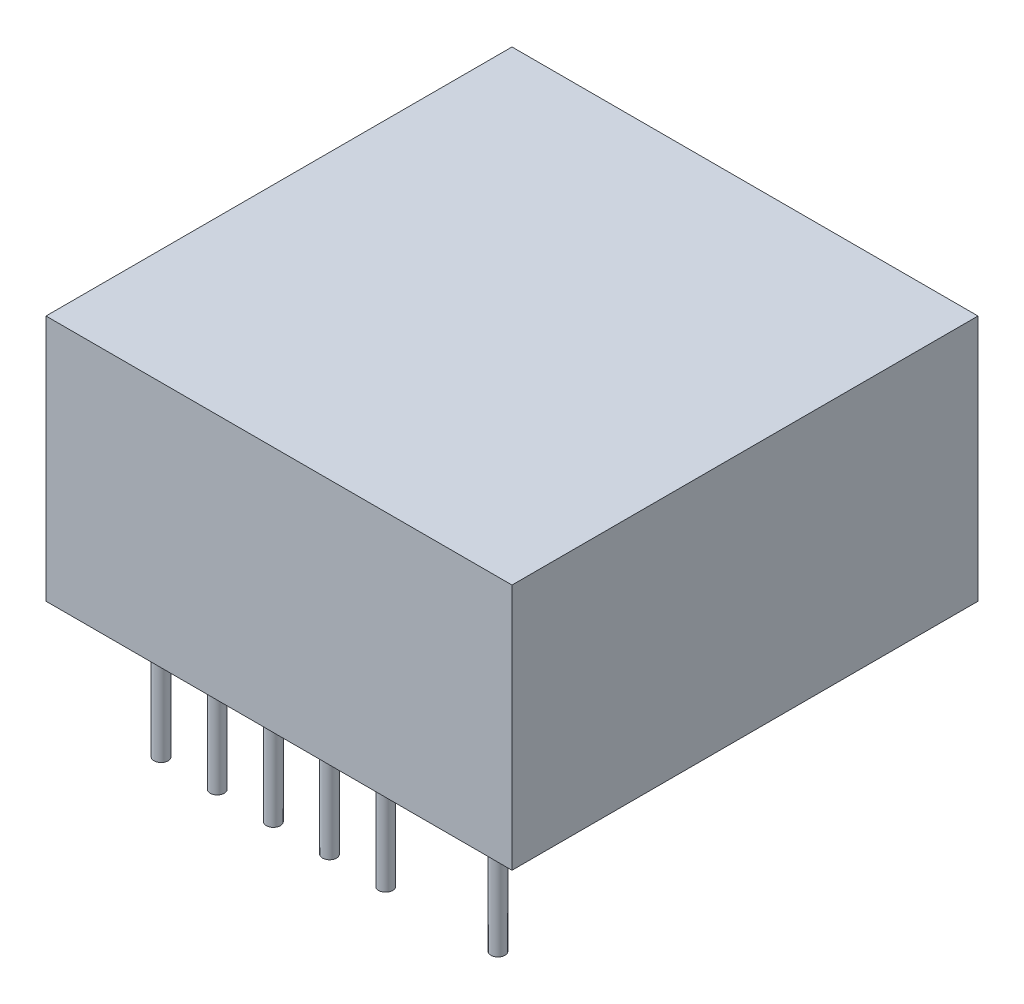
ISO-10303-21;
HEADER;
FILE_DESCRIPTION(('STEP AP214'),'2;1');
FILE_NAME('part.step','',(''),(''),'','','');
FILE_SCHEMA(('AUTOMOTIVE_DESIGN { 1 0 10303 214 1 1 1 1 }'));
ENDSEC;
DATA;
#1=APPLICATION_CONTEXT('core data for automotive mechanical design processes');
#2=APPLICATION_PROTOCOL_DEFINITION('international standard','automotive_design',2000,#1);
#3=PRODUCT_CONTEXT('',#1,'mechanical');
#4=PRODUCT('Part','Part','',(#3));
#5=PRODUCT_RELATED_PRODUCT_CATEGORY('part','',(#4));
#6=PRODUCT_DEFINITION_FORMATION('','',#4);
#7=PRODUCT_DEFINITION_CONTEXT('part definition',#1,'design');
#8=PRODUCT_DEFINITION('design','',#6,#7);
#9=PRODUCT_DEFINITION_SHAPE('','',#8);
#10=(LENGTH_UNIT() NAMED_UNIT(*) SI_UNIT(.MILLI.,.METRE.));
#11=(NAMED_UNIT(*) PLANE_ANGLE_UNIT() SI_UNIT($,.RADIAN.));
#12=(NAMED_UNIT(*) SI_UNIT($,.STERADIAN.) SOLID_ANGLE_UNIT());
#13=UNCERTAINTY_MEASURE_WITH_UNIT(LENGTH_MEASURE(1.E-05),#10,'distance_accuracy_value','');
#14=(GEOMETRIC_REPRESENTATION_CONTEXT(3) GLOBAL_UNCERTAINTY_ASSIGNED_CONTEXT((#13)) GLOBAL_UNIT_ASSIGNED_CONTEXT((#10,
#11,#12)) REPRESENTATION_CONTEXT('',''));
#15=CARTESIAN_POINT('',(0.,0.,0.));
#16=DIRECTION('',(0.,0.,1.));
#17=DIRECTION('',(1.,0.,0.));
#18=AXIS2_PLACEMENT_3D('',#15,#16,#17);
#19=CARTESIAN_POINT('',(0.,11.176,0.));
#20=DIRECTION('',(1.,0.,0.));
#21=DIRECTION('',(0.,0.,-1.));
#22=AXIS2_PLACEMENT_3D('',#19,#20,#21);
#23=PLANE('',#22);
#24=DIRECTION('',(0.,0.,1.));
#25=VECTOR('',#24,1.);
#26=CARTESIAN_POINT('',(0.,0.,0.));
#27=LINE('',#26,#25);
#28=CARTESIAN_POINT('',(0.,0.,-21.082));
#29=VERTEX_POINT('',#28);
#30=CARTESIAN_POINT('',(0.,0.,0.));
#31=VERTEX_POINT('',#30);
#32=EDGE_CURVE('E111',#29,#31,#27,.T.);
#33=ORIENTED_EDGE('',*,*,#32,.T.);
#34=DIRECTION('',(0.,-1.,0.));
#35=VECTOR('',#34,1.);
#36=CARTESIAN_POINT('',(0.,11.176,0.));
#37=LINE('',#36,#35);
#38=CARTESIAN_POINT('',(0.,11.176,0.));
#39=VERTEX_POINT('',#38);
#40=EDGE_CURVE('E11',#39,#31,#37,.T.);
#41=ORIENTED_EDGE('',*,*,#40,.F.);
#42=DIRECTION('',(0.,0.,1.));
#43=VECTOR('',#42,1.);
#44=CARTESIAN_POINT('',(0.,11.176,0.));
#45=LINE('',#44,#43);
#46=CARTESIAN_POINT('',(0.,11.176,-21.082));
#47=VERTEX_POINT('',#46);
#48=EDGE_CURVE('E95',#47,#39,#45,.T.);
#49=ORIENTED_EDGE('',*,*,#48,.F.);
#50=DIRECTION('',(0.,-1.,0.));
#51=VECTOR('',#50,1.);
#52=CARTESIAN_POINT('',(0.,11.176,-21.082));
#53=LINE('',#52,#51);
#54=EDGE_CURVE('E107',#47,#29,#53,.T.);
#55=ORIENTED_EDGE('',*,*,#54,.T.);
#56=EDGE_LOOP('',(#33,#41,#49,#55));
#57=FACE_BOUND('',#56,.T.);
#58=ADVANCED_FACE('F43',(#57),#23,.F.);
#59=CARTESIAN_POINT('',(0.,11.176,0.));
#60=DIRECTION('',(0.,0.,-1.));
#61=DIRECTION('',(-1.,0.,0.));
#62=AXIS2_PLACEMENT_3D('',#59,#60,#61);
#63=PLANE('',#62);
#64=DIRECTION('',(1.,0.,0.));
#65=VECTOR('',#64,1.);
#66=CARTESIAN_POINT('',(0.,0.,0.));
#67=LINE('',#66,#65);
#68=CARTESIAN_POINT('',(21.082,0.,0.));
#69=VERTEX_POINT('',#68);
#70=EDGE_CURVE('E100',#31,#69,#67,.T.);
#71=ORIENTED_EDGE('',*,*,#70,.T.);
#72=DIRECTION('',(0.,-1.,0.));
#73=VECTOR('',#72,1.);
#74=CARTESIAN_POINT('',(21.082,11.176,0.));
#75=LINE('',#74,#73);
#76=CARTESIAN_POINT('',(21.082,11.176,0.));
#77=VERTEX_POINT('',#76);
#78=EDGE_CURVE('E52',#77,#69,#75,.T.);
#79=ORIENTED_EDGE('',*,*,#78,.F.);
#80=DIRECTION('',(1.,0.,0.));
#81=VECTOR('',#80,1.);
#82=CARTESIAN_POINT('',(0.,11.176,0.));
#83=LINE('',#82,#81);
#84=EDGE_CURVE('E90',#39,#77,#83,.T.);
#85=ORIENTED_EDGE('',*,*,#84,.F.);
#86=ORIENTED_EDGE('',*,*,#40,.T.);
#87=EDGE_LOOP('',(#71,#79,#85,#86));
#88=FACE_BOUND('',#87,.T.);
#89=ADVANCED_FACE('F99',(#88),#63,.F.);
#90=CARTESIAN_POINT('',(21.082,11.176,0.));
#91=DIRECTION('',(-1.,0.,0.));
#92=DIRECTION('',(0.,0.,1.));
#93=AXIS2_PLACEMENT_3D('',#90,#91,#92);
#94=PLANE('',#93);
#95=DIRECTION('',(0.,0.,-1.));
#96=VECTOR('',#95,1.);
#97=CARTESIAN_POINT('',(21.082,0.,0.));
#98=LINE('',#97,#96);
#99=CARTESIAN_POINT('',(21.082,0.,-21.082));
#100=VERTEX_POINT('',#99);
#101=EDGE_CURVE('E77',#69,#100,#98,.T.);
#102=ORIENTED_EDGE('',*,*,#101,.T.);
#103=DIRECTION('',(0.,-1.,0.));
#104=VECTOR('',#103,1.);
#105=CARTESIAN_POINT('',(21.082,11.176,-21.082));
#106=LINE('',#105,#104);
#107=CARTESIAN_POINT('',(21.082,11.176,-21.082));
#108=VERTEX_POINT('',#107);
#109=EDGE_CURVE('E102',#108,#100,#106,.T.);
#110=ORIENTED_EDGE('',*,*,#109,.F.);
#111=DIRECTION('',(0.,0.,-1.));
#112=VECTOR('',#111,1.);
#113=CARTESIAN_POINT('',(21.082,11.176,0.));
#114=LINE('',#113,#112);
#115=EDGE_CURVE('E93',#77,#108,#114,.T.);
#116=ORIENTED_EDGE('',*,*,#115,.F.);
#117=ORIENTED_EDGE('',*,*,#78,.T.);
#118=EDGE_LOOP('',(#102,#110,#116,#117));
#119=FACE_BOUND('',#118,.T.);
#120=ADVANCED_FACE('F103',(#119),#94,.F.);
#121=CARTESIAN_POINT('',(0.,11.176,-21.082));
#122=DIRECTION('',(0.,0.,1.));
#123=DIRECTION('',(1.,0.,0.));
#124=AXIS2_PLACEMENT_3D('',#121,#122,#123);
#125=PLANE('',#124);
#126=DIRECTION('',(-1.,0.,0.));
#127=VECTOR('',#126,1.);
#128=CARTESIAN_POINT('',(0.,0.,-21.082));
#129=LINE('',#128,#127);
#130=EDGE_CURVE('E83',#100,#29,#129,.T.);
#131=ORIENTED_EDGE('',*,*,#130,.T.);
#132=ORIENTED_EDGE('',*,*,#54,.F.);
#133=DIRECTION('',(-1.,0.,0.));
#134=VECTOR('',#133,1.);
#135=CARTESIAN_POINT('',(0.,11.176,-21.082));
#136=LINE('',#135,#134);
#137=EDGE_CURVE('E60',#108,#47,#136,.T.);
#138=ORIENTED_EDGE('',*,*,#137,.F.);
#139=ORIENTED_EDGE('',*,*,#109,.T.);
#140=EDGE_LOOP('',(#131,#132,#138,#139));
#141=FACE_BOUND('',#140,.T.);
#142=ADVANCED_FACE('F125',(#141),#125,.F.);
#143=CARTESIAN_POINT('',(0.,11.176,0.));
#144=DIRECTION('',(0.,-1.,0.));
#145=DIRECTION('',(0.,0.,-1.));
#146=AXIS2_PLACEMENT_3D('',#143,#144,#145);
#147=PLANE('',#146);
#148=ORIENTED_EDGE('',*,*,#48,.T.);
#149=ORIENTED_EDGE('',*,*,#84,.T.);
#150=ORIENTED_EDGE('',*,*,#115,.T.);
#151=ORIENTED_EDGE('',*,*,#137,.T.);
#152=EDGE_LOOP('',(#148,#149,#150,#151));
#153=FACE_BOUND('',#152,.T.);
#154=ADVANCED_FACE('F91',(#153),#147,.F.);
#155=CARTESIAN_POINT('',(0.,0.,0.));
#156=DIRECTION('',(0.,-1.,0.));
#157=DIRECTION('',(0.,0.,-1.));
#158=AXIS2_PLACEMENT_3D('',#155,#156,#157);
#159=PLANE('',#158);
#160=CARTESIAN_POINT('',(18.0975,0.,-2.3495));
#161=DIRECTION('',(0.,-1.,0.));
#162=DIRECTION('',(0.,0.,-1.));
#163=AXIS2_PLACEMENT_3D('',#160,#161,#162);
#164=CIRCLE('',#163,0.317500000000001);
#165=CARTESIAN_POINT('',(18.0975,0.,-2.667));
#166=VERTEX_POINT('',#165);
#167=EDGE_CURVE('E168',#166,#166,#164,.T.);
#168=ORIENTED_EDGE('',*,*,#167,.F.);
#169=EDGE_LOOP('',(#168));
#170=FACE_BOUND('',#169,.T.);
#171=CARTESIAN_POINT('',(13.0175,0.,-2.3495));
#172=DIRECTION('',(0.,-1.,0.));
#173=DIRECTION('',(0.,0.,-1.));
#174=AXIS2_PLACEMENT_3D('',#171,#172,#173);
#175=CIRCLE('',#174,0.3175);
#176=CARTESIAN_POINT('',(13.0175,0.,-2.667));
#177=VERTEX_POINT('',#176);
#178=EDGE_CURVE('E160',#177,#177,#175,.T.);
#179=ORIENTED_EDGE('',*,*,#178,.F.);
#180=EDGE_LOOP('',(#179));
#181=FACE_BOUND('',#180,.T.);
#182=CARTESIAN_POINT('',(10.4775,0.,-2.3495));
#183=DIRECTION('',(0.,-1.,0.));
#184=DIRECTION('',(0.,0.,-1.));
#185=AXIS2_PLACEMENT_3D('',#182,#183,#184);
#186=CIRCLE('',#185,0.3175);
#187=CARTESIAN_POINT('',(10.4775,0.,-2.667));
#188=VERTEX_POINT('',#187);
#189=EDGE_CURVE('E152',#188,#188,#186,.T.);
#190=ORIENTED_EDGE('',*,*,#189,.F.);
#191=EDGE_LOOP('',(#190));
#192=FACE_BOUND('',#191,.T.);
#193=CARTESIAN_POINT('',(7.9375,0.,-2.3495));
#194=DIRECTION('',(0.,-1.,0.));
#195=DIRECTION('',(0.,0.,-1.));
#196=AXIS2_PLACEMENT_3D('',#193,#194,#195);
#197=CIRCLE('',#196,0.3175);
#198=CARTESIAN_POINT('',(7.9375,0.,-2.667));
#199=VERTEX_POINT('',#198);
#200=EDGE_CURVE('E144',#199,#199,#197,.T.);
#201=ORIENTED_EDGE('',*,*,#200,.F.);
#202=EDGE_LOOP('',(#201));
#203=FACE_BOUND('',#202,.T.);
#204=CARTESIAN_POINT('',(5.3975,0.,-2.3495));
#205=DIRECTION('',(0.,-1.,0.));
#206=DIRECTION('',(0.,0.,-1.));
#207=AXIS2_PLACEMENT_3D('',#204,#205,#206);
#208=CIRCLE('',#207,0.3175);
#209=CARTESIAN_POINT('',(5.3975,0.,-2.667));
#210=VERTEX_POINT('',#209);
#211=EDGE_CURVE('E136',#210,#210,#208,.T.);
#212=ORIENTED_EDGE('',*,*,#211,.F.);
#213=EDGE_LOOP('',(#212));
#214=FACE_BOUND('',#213,.T.);
#215=CARTESIAN_POINT('',(2.8575,0.,-2.3495));
#216=DIRECTION('',(0.,-1.,0.));
#217=DIRECTION('',(0.,0.,-1.));
#218=AXIS2_PLACEMENT_3D('',#215,#216,#217);
#219=CIRCLE('',#218,0.3175);
#220=CARTESIAN_POINT('',(2.8575,0.,-2.667));
#221=VERTEX_POINT('',#220);
#222=EDGE_CURVE('E132',#221,#221,#219,.T.);
#223=ORIENTED_EDGE('',*,*,#222,.F.);
#224=EDGE_LOOP('',(#223));
#225=FACE_BOUND('',#224,.T.);
#226=ORIENTED_EDGE('',*,*,#32,.F.);
#227=ORIENTED_EDGE('',*,*,#130,.F.);
#228=ORIENTED_EDGE('',*,*,#101,.F.);
#229=ORIENTED_EDGE('',*,*,#70,.F.);
#230=EDGE_LOOP('',(#226,#227,#228,#229));
#231=FACE_BOUND('',#230,.T.);
#232=ADVANCED_FACE('F128',(#170,#181,#192,#203,#214,#225,#231),#159,.T.);
#233=CARTESIAN_POINT('',(2.8575,-5.842,-2.3495));
#234=DIRECTION('',(0.,1.,0.));
#235=DIRECTION('',(0.,0.,1.));
#236=AXIS2_PLACEMENT_3D('',#233,#234,#235);
#237=CYLINDRICAL_SURFACE('',#236,0.3175);
#238=CARTESIAN_POINT('',(2.8575,-5.842,-2.3495));
#239=DIRECTION('',(0.,-1.,0.));
#240=DIRECTION('',(0.,0.,-1.));
#241=AXIS2_PLACEMENT_3D('',#238,#239,#240);
#242=CIRCLE('',#241,0.3175);
#243=CARTESIAN_POINT('',(2.8575,-5.842,-2.667));
#244=VERTEX_POINT('',#243);
#245=EDGE_CURVE('E115',#244,#244,#242,.T.);
#246=ORIENTED_EDGE('',*,*,#245,.F.);
#247=EDGE_LOOP('',(#246));
#248=FACE_BOUND('',#247,.T.);
#249=ORIENTED_EDGE('',*,*,#222,.T.);
#250=EDGE_LOOP('',(#249));
#251=FACE_BOUND('',#250,.T.);
#252=ADVANCED_FACE('F184',(#248,#251),#237,.T.);
#253=CARTESIAN_POINT('',(2.8575,-5.842,-2.3495));
#254=DIRECTION('',(0.,-1.,0.));
#255=DIRECTION('',(0.,0.,-1.));
#256=AXIS2_PLACEMENT_3D('',#253,#254,#255);
#257=PLANE('',#256);
#258=ORIENTED_EDGE('',*,*,#245,.T.);
#259=EDGE_LOOP('',(#258));
#260=FACE_BOUND('',#259,.T.);
#261=ADVANCED_FACE('F197',(#260),#257,.T.);
#262=CARTESIAN_POINT('',(5.3975,-5.842,-2.3495));
#263=DIRECTION('',(0.,1.,0.));
#264=DIRECTION('',(0.,0.,1.));
#265=AXIS2_PLACEMENT_3D('',#262,#263,#264);
#266=CYLINDRICAL_SURFACE('',#265,0.3175);
#267=CARTESIAN_POINT('',(5.3975,-5.842,-2.3495));
#268=DIRECTION('',(0.,-1.,0.));
#269=DIRECTION('',(0.,0.,-1.));
#270=AXIS2_PLACEMENT_3D('',#267,#268,#269);
#271=CIRCLE('',#270,0.3175);
#272=CARTESIAN_POINT('',(5.3975,-5.842,-2.667));
#273=VERTEX_POINT('',#272);
#274=EDGE_CURVE('E140',#273,#273,#271,.T.);
#275=ORIENTED_EDGE('',*,*,#274,.F.);
#276=EDGE_LOOP('',(#275));
#277=FACE_BOUND('',#276,.T.);
#278=ORIENTED_EDGE('',*,*,#211,.T.);
#279=EDGE_LOOP('',(#278));
#280=FACE_BOUND('',#279,.T.);
#281=ADVANCED_FACE('F203',(#277,#280),#266,.T.);
#282=CARTESIAN_POINT('',(5.3975,-5.842,-2.3495));
#283=DIRECTION('',(0.,-1.,0.));
#284=DIRECTION('',(0.,0.,-1.));
#285=AXIS2_PLACEMENT_3D('',#282,#283,#284);
#286=PLANE('',#285);
#287=ORIENTED_EDGE('',*,*,#274,.T.);
#288=EDGE_LOOP('',(#287));
#289=FACE_BOUND('',#288,.T.);
#290=ADVANCED_FACE('F249',(#289),#286,.T.);
#291=CARTESIAN_POINT('',(7.9375,-5.842,-2.3495));
#292=DIRECTION('',(0.,1.,0.));
#293=DIRECTION('',(0.,0.,1.));
#294=AXIS2_PLACEMENT_3D('',#291,#292,#293);
#295=CYLINDRICAL_SURFACE('',#294,0.3175);
#296=CARTESIAN_POINT('',(7.9375,-5.842,-2.3495));
#297=DIRECTION('',(0.,-1.,0.));
#298=DIRECTION('',(0.,0.,-1.));
#299=AXIS2_PLACEMENT_3D('',#296,#297,#298);
#300=CIRCLE('',#299,0.3175);
#301=CARTESIAN_POINT('',(7.9375,-5.842,-2.667));
#302=VERTEX_POINT('',#301);
#303=EDGE_CURVE('E148',#302,#302,#300,.T.);
#304=ORIENTED_EDGE('',*,*,#303,.F.);
#305=EDGE_LOOP('',(#304));
#306=FACE_BOUND('',#305,.T.);
#307=ORIENTED_EDGE('',*,*,#200,.T.);
#308=EDGE_LOOP('',(#307));
#309=FACE_BOUND('',#308,.T.);
#310=ADVANCED_FACE('F260',(#306,#309),#295,.T.);
#311=CARTESIAN_POINT('',(7.9375,-5.842,-2.3495));
#312=DIRECTION('',(0.,-1.,0.));
#313=DIRECTION('',(0.,0.,-1.));
#314=AXIS2_PLACEMENT_3D('',#311,#312,#313);
#315=PLANE('',#314);
#316=ORIENTED_EDGE('',*,*,#303,.T.);
#317=EDGE_LOOP('',(#316));
#318=FACE_BOUND('',#317,.T.);
#319=ADVANCED_FACE('F271',(#318),#315,.T.);
#320=CARTESIAN_POINT('',(10.4775,-5.842,-2.3495));
#321=DIRECTION('',(0.,1.,0.));
#322=DIRECTION('',(0.,0.,1.));
#323=AXIS2_PLACEMENT_3D('',#320,#321,#322);
#324=CYLINDRICAL_SURFACE('',#323,0.3175);
#325=CARTESIAN_POINT('',(10.4775,-5.842,-2.3495));
#326=DIRECTION('',(0.,-1.,0.));
#327=DIRECTION('',(0.,0.,-1.));
#328=AXIS2_PLACEMENT_3D('',#325,#326,#327);
#329=CIRCLE('',#328,0.3175);
#330=CARTESIAN_POINT('',(10.4775,-5.842,-2.667));
#331=VERTEX_POINT('',#330);
#332=EDGE_CURVE('E156',#331,#331,#329,.T.);
#333=ORIENTED_EDGE('',*,*,#332,.F.);
#334=EDGE_LOOP('',(#333));
#335=FACE_BOUND('',#334,.T.);
#336=ORIENTED_EDGE('',*,*,#189,.T.);
#337=EDGE_LOOP('',(#336));
#338=FACE_BOUND('',#337,.T.);
#339=ADVANCED_FACE('F282',(#335,#338),#324,.T.);
#340=CARTESIAN_POINT('',(10.4775,-5.842,-2.3495));
#341=DIRECTION('',(0.,-1.,0.));
#342=DIRECTION('',(0.,0.,-1.));
#343=AXIS2_PLACEMENT_3D('',#340,#341,#342);
#344=PLANE('',#343);
#345=ORIENTED_EDGE('',*,*,#332,.T.);
#346=EDGE_LOOP('',(#345));
#347=FACE_BOUND('',#346,.T.);
#348=ADVANCED_FACE('F293',(#347),#344,.T.);
#349=CARTESIAN_POINT('',(13.0175,-5.842,-2.3495));
#350=DIRECTION('',(0.,1.,0.));
#351=DIRECTION('',(0.,0.,1.));
#352=AXIS2_PLACEMENT_3D('',#349,#350,#351);
#353=CYLINDRICAL_SURFACE('',#352,0.3175);
#354=CARTESIAN_POINT('',(13.0175,-5.842,-2.3495));
#355=DIRECTION('',(0.,-1.,0.));
#356=DIRECTION('',(0.,0.,-1.));
#357=AXIS2_PLACEMENT_3D('',#354,#355,#356);
#358=CIRCLE('',#357,0.3175);
#359=CARTESIAN_POINT('',(13.0175,-5.842,-2.667));
#360=VERTEX_POINT('',#359);
#361=EDGE_CURVE('E164',#360,#360,#358,.T.);
#362=ORIENTED_EDGE('',*,*,#361,.F.);
#363=EDGE_LOOP('',(#362));
#364=FACE_BOUND('',#363,.T.);
#365=ORIENTED_EDGE('',*,*,#178,.T.);
#366=EDGE_LOOP('',(#365));
#367=FACE_BOUND('',#366,.T.);
#368=ADVANCED_FACE('F304',(#364,#367),#353,.T.);
#369=CARTESIAN_POINT('',(13.0175,-5.842,-2.3495));
#370=DIRECTION('',(0.,-1.,0.));
#371=DIRECTION('',(0.,0.,-1.));
#372=AXIS2_PLACEMENT_3D('',#369,#370,#371);
#373=PLANE('',#372);
#374=ORIENTED_EDGE('',*,*,#361,.T.);
#375=EDGE_LOOP('',(#374));
#376=FACE_BOUND('',#375,.T.);
#377=ADVANCED_FACE('F315',(#376),#373,.T.);
#378=CARTESIAN_POINT('',(18.0975,-5.842,-2.3495));
#379=DIRECTION('',(0.,1.,0.));
#380=DIRECTION('',(0.,0.,1.));
#381=AXIS2_PLACEMENT_3D('',#378,#379,#380);
#382=CYLINDRICAL_SURFACE('',#381,0.317500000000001);
#383=CARTESIAN_POINT('',(18.0975,-5.842,-2.3495));
#384=DIRECTION('',(0.,-1.,0.));
#385=DIRECTION('',(0.,0.,-1.));
#386=AXIS2_PLACEMENT_3D('',#383,#384,#385);
#387=CIRCLE('',#386,0.317500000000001);
#388=CARTESIAN_POINT('',(18.0975,-5.842,-2.667));
#389=VERTEX_POINT('',#388);
#390=EDGE_CURVE('E172',#389,#389,#387,.T.);
#391=ORIENTED_EDGE('',*,*,#390,.F.);
#392=EDGE_LOOP('',(#391));
#393=FACE_BOUND('',#392,.T.);
#394=ORIENTED_EDGE('',*,*,#167,.T.);
#395=EDGE_LOOP('',(#394));
#396=FACE_BOUND('',#395,.T.);
#397=ADVANCED_FACE('F180',(#393,#396),#382,.T.);
#398=CARTESIAN_POINT('',(18.0975,-5.842,-2.3495));
#399=DIRECTION('',(0.,-1.,0.));
#400=DIRECTION('',(0.,0.,-1.));
#401=AXIS2_PLACEMENT_3D('',#398,#399,#400);
#402=PLANE('',#401);
#403=ORIENTED_EDGE('',*,*,#390,.T.);
#404=EDGE_LOOP('',(#403));
#405=FACE_BOUND('',#404,.T.);
#406=ADVANCED_FACE('F336',(#405),#402,.T.);
#407=CLOSED_SHELL('',(#58,#89,#120,#142,#154,#232,#252,#261,#281,#290,#310,#319,#339,#348,#368,
#377,#397,#406));
#408=MANIFOLD_SOLID_BREP('B2',#407);
#409=ADVANCED_BREP_SHAPE_REPRESENTATION('',(#18,#408),#14);
#410=SHAPE_DEFINITION_REPRESENTATION(#9,#409);
ENDSEC;
END-ISO-10303-21;
